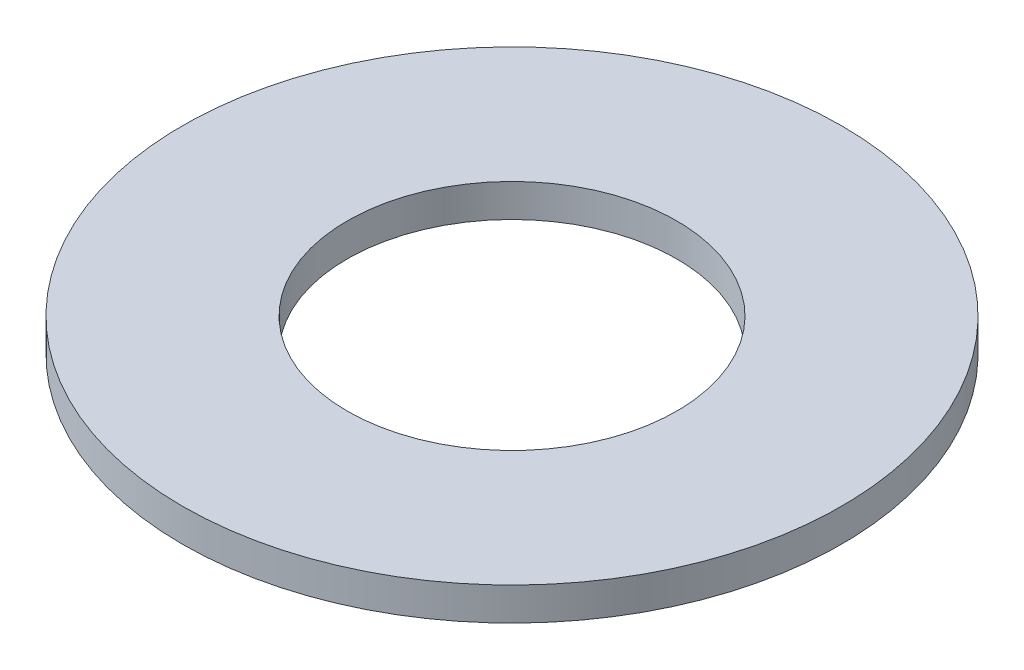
from build123d import *

# Parameters (mm, degrees)
SKETCH1_R           = 25.4
SKETCH1_R_2         = 12.7
BOSS_EXTRUDE1_DEPTH = 2.54


with BuildPart() as part:
    # Sketch1 → Boss-Extrude1 (new body)
    with BuildSketch(Plane(origin=(0, 0, 0), x_dir=(1, 0, 0), z_dir=(0, 1, 0))):
        with Locations(Location((0, 0, 0), (0, 0, 270))):
            Circle(SKETCH1_R)
        with Locations(Location((0, 0, 0), (0, 0, 270))):
            Circle(SKETCH1_R_2, mode=Mode.SUBTRACT)
    extrude(amount=BOSS_EXTRUDE1_DEPTH)


solid = part.part
